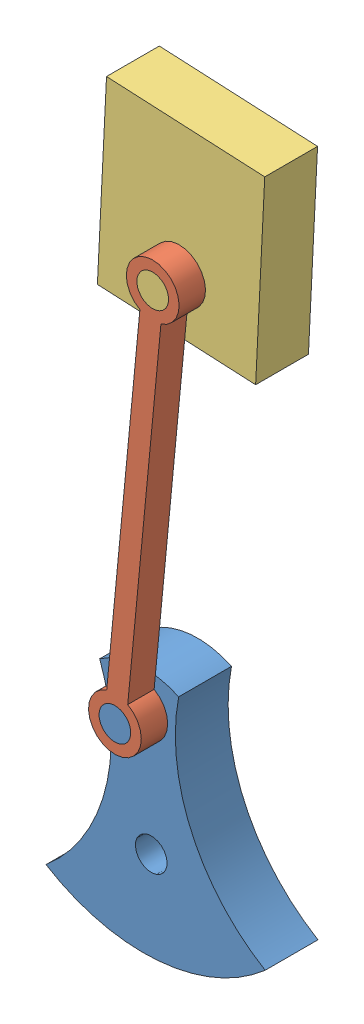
SolidWorks assembly c17-tut01.SLDASM, configuration Default (file format 7000). Lengths in mm.
Overall size (50 198.56 15).
3 component instances, 3 part files, 0 mates.
Components (placement in the parent):
- Block-Crank-1-1-1: Block-Crank-1-1.sldprt [Default] at (-1.8869 22.9225 0) x (0.996629 0.082038 0) z (0 0 1) size (41.64 46.75 15)
- Piston_rod-1-2-1: Piston_rod-1-2.sldprt [Default] at (5.2763 97.5796 0) x (0.995429 -0.095509 0) z (0 0 1) size (10 85 5)
- Piston_tank-1-3-1: Piston_tank-1-3.sldprt [Default] at (5.2763 97.5796 0) x (0.998786 -0.049263 0) z (0 0 1) size (30 35 15)
